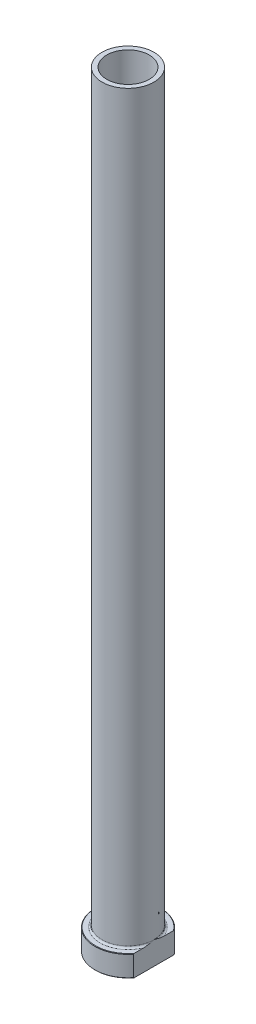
ISO-10303-21;
HEADER;
FILE_DESCRIPTION(('STEP AP214'),'2;1');
FILE_NAME('part.step','',(''),(''),'','','');
FILE_SCHEMA(('AUTOMOTIVE_DESIGN { 1 0 10303 214 1 1 1 1 }'));
ENDSEC;
DATA;
#1=APPLICATION_CONTEXT('core data for automotive mechanical design processes');
#2=APPLICATION_PROTOCOL_DEFINITION('international standard','automotive_design',2000,#1);
#3=PRODUCT_CONTEXT('',#1,'mechanical');
#4=PRODUCT('Part','Part','',(#3));
#5=PRODUCT_RELATED_PRODUCT_CATEGORY('part','',(#4));
#6=PRODUCT_DEFINITION_FORMATION('','',#4);
#7=PRODUCT_DEFINITION_CONTEXT('part definition',#1,'design');
#8=PRODUCT_DEFINITION('design','',#6,#7);
#9=PRODUCT_DEFINITION_SHAPE('','',#8);
#10=(LENGTH_UNIT() NAMED_UNIT(*) SI_UNIT(.MILLI.,.METRE.));
#11=(NAMED_UNIT(*) PLANE_ANGLE_UNIT() SI_UNIT($,.RADIAN.));
#12=(NAMED_UNIT(*) SI_UNIT($,.STERADIAN.) SOLID_ANGLE_UNIT());
#13=UNCERTAINTY_MEASURE_WITH_UNIT(LENGTH_MEASURE(1.E-05),#10,'distance_accuracy_value','');
#14=(GEOMETRIC_REPRESENTATION_CONTEXT(3) GLOBAL_UNCERTAINTY_ASSIGNED_CONTEXT((#13)) GLOBAL_UNIT_ASSIGNED_CONTEXT((#10,
#11,#12)) REPRESENTATION_CONTEXT('',''));
#15=CARTESIAN_POINT('',(0.,0.,0.));
#16=DIRECTION('',(0.,0.,1.));
#17=DIRECTION('',(1.,0.,0.));
#18=AXIS2_PLACEMENT_3D('',#15,#16,#17);
#19=CARTESIAN_POINT('',(0.,92.1876809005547,0.));
#20=DIRECTION('',(0.,1.,0.));
#21=DIRECTION('',(0.,0.,1.));
#22=AXIS2_PLACEMENT_3D('',#19,#20,#21);
#23=CYLINDRICAL_SURFACE('',#22,9.00000000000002);
#24=CARTESIAN_POINT('',(0.,325.,0.));
#25=DIRECTION('',(0.,1.,0.));
#26=DIRECTION('',(0.,0.,1.));
#27=AXIS2_PLACEMENT_3D('',#24,#25,#26);
#28=CIRCLE('',#27,9.00000000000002);
#29=CARTESIAN_POINT('',(0.,325.,9.00000000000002));
#30=VERTEX_POINT('',#29);
#31=EDGE_CURVE('E167',#30,#30,#28,.T.);
#32=ORIENTED_EDGE('',*,*,#31,.T.);
#33=EDGE_LOOP('',(#32));
#34=FACE_BOUND('',#33,.T.);
#35=CARTESIAN_POINT('',(0.,270.,0.));
#36=DIRECTION('',(0.,1.,0.));
#37=DIRECTION('',(0.,0.,1.));
#38=AXIS2_PLACEMENT_3D('',#35,#36,#37);
#39=CIRCLE('',#38,9.00000000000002);
#40=CARTESIAN_POINT('',(0.,270.,9.00000000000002));
#41=VERTEX_POINT('',#40);
#42=EDGE_CURVE('E170',#41,#41,#39,.T.);
#43=ORIENTED_EDGE('',*,*,#42,.F.);
#44=EDGE_LOOP('',(#43));
#45=FACE_BOUND('',#44,.T.);
#46=ADVANCED_FACE('F32',(#34,#45),#23,.F.);
#47=CARTESIAN_POINT('',(-9.00000000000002,325.,0.));
#48=DIRECTION('',(0.,1.,0.));
#49=DIRECTION('',(0.,0.,1.));
#50=AXIS2_PLACEMENT_3D('',#47,#48,#49);
#51=PLANE('',#50);
#52=CARTESIAN_POINT('',(0.,325.,0.));
#53=DIRECTION('',(0.,1.,0.));
#54=DIRECTION('',(0.,0.,1.));
#55=AXIS2_PLACEMENT_3D('',#52,#53,#54);
#56=CIRCLE('',#55,11.);
#57=CARTESIAN_POINT('',(0.,325.,11.));
#58=VERTEX_POINT('',#57);
#59=EDGE_CURVE('E174',#58,#58,#56,.T.);
#60=ORIENTED_EDGE('',*,*,#59,.T.);
#61=EDGE_LOOP('',(#60));
#62=FACE_BOUND('',#61,.T.);
#63=ORIENTED_EDGE('',*,*,#31,.F.);
#64=EDGE_LOOP('',(#63));
#65=FACE_BOUND('',#64,.T.);
#66=ADVANCED_FACE('F157',(#62,#65),#51,.T.);
#67=CARTESIAN_POINT('',(0.,92.1876809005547,0.));
#68=DIRECTION('',(0.,1.,0.));
#69=DIRECTION('',(0.,0.,1.));
#70=AXIS2_PLACEMENT_3D('',#67,#68,#69);
#71=CYLINDRICAL_SURFACE('',#70,11.);
#72=CARTESIAN_POINT('',(0.,9.8,0.));
#73=DIRECTION('',(0.,1.,0.));
#74=DIRECTION('',(0.,0.,1.));
#75=AXIS2_PLACEMENT_3D('',#72,#73,#74);
#76=CIRCLE('',#75,11.);
#77=CARTESIAN_POINT('',(11.,9.8,0.));
#78=VERTEX_POINT('',#77);
#79=EDGE_CURVE('E180',#78,#78,#76,.T.);
#80=ORIENTED_EDGE('',*,*,#79,.T.);
#81=EDGE_LOOP('',(#80));
#82=FACE_BOUND('',#81,.T.);
#83=ORIENTED_EDGE('',*,*,#59,.F.);
#84=EDGE_LOOP('',(#83));
#85=FACE_BOUND('',#84,.T.);
#86=ADVANCED_FACE('F162',(#82,#85),#71,.T.);
#87=CARTESIAN_POINT('',(-11.,9.,0.));
#88=DIRECTION('',(0.,1.,0.));
#89=DIRECTION('',(0.,0.,1.));
#90=AXIS2_PLACEMENT_3D('',#87,#88,#89);
#91=PLANE('',#90);
#92=DIRECTION('',(0.,0.,1.));
#93=VECTOR('',#92,1.);
#94=CARTESIAN_POINT('',(11.,9.,0.));
#95=LINE('',#94,#93);
#96=CARTESIAN_POINT('',(11.,9.,-8.33306666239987));
#97=VERTEX_POINT('',#96);
#98=CARTESIAN_POINT('',(11.,9.,-4.27083130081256));
#99=VERTEX_POINT('',#98);
#100=EDGE_CURVE('E54',#97,#99,#95,.T.);
#101=ORIENTED_EDGE('',*,*,#100,.F.);
#102=CARTESIAN_POINT('',(0.,9.,0.));
#103=DIRECTION('',(0.,1.,0.));
#104=DIRECTION('',(0.,0.,1.));
#105=AXIS2_PLACEMENT_3D('',#102,#103,#104);
#106=CIRCLE('',#105,13.8);
#107=CARTESIAN_POINT('',(11.,9.,8.33306666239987));
#108=VERTEX_POINT('',#107);
#109=EDGE_CURVE('E186',#97,#108,#106,.T.);
#110=ORIENTED_EDGE('',*,*,#109,.T.);
#111=CARTESIAN_POINT('',(11.,9.,4.27083130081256));
#112=VERTEX_POINT('',#111);
#113=EDGE_CURVE('E134',#112,#108,#95,.T.);
#114=ORIENTED_EDGE('',*,*,#113,.F.);
#115=CARTESIAN_POINT('',(0.,9.,0.));
#116=DIRECTION('',(0.,1.,0.));
#117=DIRECTION('',(0.,0.,1.));
#118=AXIS2_PLACEMENT_3D('',#115,#116,#117);
#119=CIRCLE('',#118,11.8);
#120=EDGE_CURVE('E183',#112,#99,#119,.F.);
#121=ORIENTED_EDGE('',*,*,#120,.T.);
#122=EDGE_LOOP('',(#101,#110,#114,#121));
#123=FACE_BOUND('',#122,.T.);
#124=ADVANCED_FACE('F197',(#123),#91,.T.);
#125=CARTESIAN_POINT('',(0.,92.1876809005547,0.));
#126=DIRECTION('',(0.,1.,0.));
#127=DIRECTION('',(0.,0.,1.));
#128=AXIS2_PLACEMENT_3D('',#125,#126,#127);
#129=CYLINDRICAL_SURFACE('',#128,14.);
#130=DIRECTION('',(0.,-1.,0.));
#131=VECTOR('',#130,1.);
#132=CARTESIAN_POINT('',(11.,325.,8.66025403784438));
#133=LINE('',#132,#131);
#134=CARTESIAN_POINT('',(11.,8.8,8.66025403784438));
#135=VERTEX_POINT('',#134);
#136=CARTESIAN_POINT('',(11.,0.200000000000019,8.66025403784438));
#137=VERTEX_POINT('',#136);
#138=EDGE_CURVE('E82',#135,#137,#133,.T.);
#139=ORIENTED_EDGE('',*,*,#138,.F.);
#140=CARTESIAN_POINT('',(0.,8.8,0.));
#141=DIRECTION('',(0.,1.,0.));
#142=DIRECTION('',(0.,0.,1.));
#143=AXIS2_PLACEMENT_3D('',#140,#141,#142);
#144=CIRCLE('',#143,14.);
#145=CARTESIAN_POINT('',(11.,8.8,-8.66025403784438));
#146=VERTEX_POINT('',#145);
#147=EDGE_CURVE('E95',#135,#146,#144,.F.);
#148=ORIENTED_EDGE('',*,*,#147,.T.);
#149=DIRECTION('',(0.,-1.,0.));
#150=VECTOR('',#149,1.);
#151=CARTESIAN_POINT('',(11.,325.,-8.66025403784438));
#152=LINE('',#151,#150);
#153=CARTESIAN_POINT('',(11.,0.20000000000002,-8.66025403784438));
#154=VERTEX_POINT('',#153);
#155=EDGE_CURVE('E192',#146,#154,#152,.T.);
#156=ORIENTED_EDGE('',*,*,#155,.T.);
#157=CARTESIAN_POINT('',(0.,0.20000000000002,0.));
#158=DIRECTION('',(0.,-1.,0.));
#159=DIRECTION('',(0.,0.,-1.));
#160=AXIS2_PLACEMENT_3D('',#157,#158,#159);
#161=CIRCLE('',#160,14.);
#162=EDGE_CURVE('E98',#154,#137,#161,.F.);
#163=ORIENTED_EDGE('',*,*,#162,.T.);
#164=EDGE_LOOP('',(#139,#148,#156,#163));
#165=FACE_BOUND('',#164,.T.);
#166=ADVANCED_FACE('F190',(#165),#129,.T.);
#167=CARTESIAN_POINT('',(-14.,0.,0.));
#168=DIRECTION('',(0.,-1.,0.));
#169=DIRECTION('',(0.,0.,-1.));
#170=AXIS2_PLACEMENT_3D('',#167,#168,#169);
#171=PLANE('',#170);
#172=CARTESIAN_POINT('',(0.,0.,0.));
#173=DIRECTION('',(0.,-1.,0.));
#174=DIRECTION('',(0.,0.,-1.));
#175=AXIS2_PLACEMENT_3D('',#172,#173,#174);
#176=CIRCLE('',#175,9.74999999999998);
#177=CARTESIAN_POINT('',(0.,0.,-9.74999999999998));
#178=VERTEX_POINT('',#177);
#179=EDGE_CURVE('E40',#178,#178,#176,.F.);
#180=ORIENTED_EDGE('',*,*,#179,.T.);
#181=EDGE_LOOP('',(#180));
#182=FACE_BOUND('',#181,.T.);
#183=DIRECTION('',(0.,0.,-1.));
#184=VECTOR('',#183,1.);
#185=CARTESIAN_POINT('',(11.,0.,8.66025403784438));
#186=LINE('',#185,#184);
#187=CARTESIAN_POINT('',(11.,0.,8.33306666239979));
#188=VERTEX_POINT('',#187);
#189=CARTESIAN_POINT('',(11.,0.,-8.33306666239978));
#190=VERTEX_POINT('',#189);
#191=EDGE_CURVE('E47',#188,#190,#186,.T.);
#192=ORIENTED_EDGE('',*,*,#191,.F.);
#193=CARTESIAN_POINT('',(0.,0.,0.));
#194=DIRECTION('',(0.,-1.,0.));
#195=DIRECTION('',(0.,0.,-1.));
#196=AXIS2_PLACEMENT_3D('',#193,#194,#195);
#197=CIRCLE('',#196,13.7999999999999);
#198=EDGE_CURVE('E92',#188,#190,#197,.T.);
#199=ORIENTED_EDGE('',*,*,#198,.T.);
#200=EDGE_LOOP('',(#192,#199));
#201=FACE_BOUND('',#200,.T.);
#202=ADVANCED_FACE('F91',(#182,#201),#171,.T.);
#203=CARTESIAN_POINT('',(0.,92.1876809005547,0.));
#204=DIRECTION('',(0.,1.,0.));
#205=DIRECTION('',(0.,0.,1.));
#206=AXIS2_PLACEMENT_3D('',#203,#204,#205);
#207=CYLINDRICAL_SURFACE('',#206,9.25000000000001);
#208=CARTESIAN_POINT('',(0.,0.499999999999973,0.));
#209=DIRECTION('',(0.,-1.,0.));
#210=DIRECTION('',(0.,0.,-1.));
#211=AXIS2_PLACEMENT_3D('',#208,#209,#210);
#212=CIRCLE('',#211,9.25000000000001);
#213=CARTESIAN_POINT('',(0.,0.499999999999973,-9.25000000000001));
#214=VERTEX_POINT('',#213);
#215=EDGE_CURVE('E11',#214,#214,#212,.T.);
#216=ORIENTED_EDGE('',*,*,#215,.T.);
#217=EDGE_LOOP('',(#216));
#218=FACE_BOUND('',#217,.T.);
#219=CARTESIAN_POINT('',(0.,258.,0.));
#220=DIRECTION('',(0.,1.,0.));
#221=DIRECTION('',(0.,0.,1.));
#222=AXIS2_PLACEMENT_3D('',#219,#220,#221);
#223=CIRCLE('',#222,9.25000000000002);
#224=CARTESIAN_POINT('',(0.,258.,9.25000000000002));
#225=VERTEX_POINT('',#224);
#226=EDGE_CURVE('E172',#225,#225,#223,.T.);
#227=ORIENTED_EDGE('',*,*,#226,.T.);
#228=EDGE_LOOP('',(#227));
#229=FACE_BOUND('',#228,.T.);
#230=ADVANCED_FACE('F215',(#218,#229),#207,.F.);
#231=CARTESIAN_POINT('',(0.,258.,0.));
#232=DIRECTION('',(0.,-1.,0.));
#233=DIRECTION('',(0.,0.,-1.));
#234=AXIS2_PLACEMENT_3D('',#231,#232,#233);
#235=CONICAL_SURFACE('',#234,9.25000000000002,0.0208303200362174);
#236=ORIENTED_EDGE('',*,*,#42,.T.);
#237=EDGE_LOOP('',(#236));
#238=FACE_BOUND('',#237,.T.);
#239=ORIENTED_EDGE('',*,*,#226,.F.);
#240=EDGE_LOOP('',(#239));
#241=FACE_BOUND('',#240,.T.);
#242=ADVANCED_FACE('F111',(#238,#241),#235,.F.);
#243=CARTESIAN_POINT('',(0.,9.8,0.));
#244=DIRECTION('',(0.,1.,0.));
#245=DIRECTION('',(0.,0.,1.));
#246=AXIS2_PLACEMENT_3D('',#243,#244,#245);
#247=TOROIDAL_SURFACE('',#246,11.8,0.8);
#248=ORIENTED_EDGE('',*,*,#120,.F.);
#249=CARTESIAN_POINT('',(11.,9.8,0.));
#250=CARTESIAN_POINT('',(11.,9.8000010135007,-1.1690142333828E-10));
#251=CARTESIAN_POINT('',(11.,9.80000202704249,3.62636844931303E-07));
#252=CARTESIAN_POINT('',(11.,9.80000392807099,1.38767088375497E-06));
#253=CARTESIAN_POINT('',(11.,9.80000479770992,2.07263830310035E-06));
#254=CARTESIAN_POINT('',(11.,9.80000659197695,3.71036756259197E-06));
#255=CARTESIAN_POINT('',(11.,9.80000749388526,4.6893031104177E-06));
#256=CARTESIAN_POINT('',(11.,9.8000091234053,6.73011686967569E-06));
#257=CARTESIAN_POINT('',(11.,9.80000985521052,7.78888257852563E-06));
#258=CARTESIAN_POINT('',(11.,9.8000125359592,1.18457672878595E-05));
#259=CARTESIAN_POINT('',(11.,9.80001433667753,1.49465092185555E-05));
#260=CARTESIAN_POINT('',(11.,9.8000173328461,2.112267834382E-05));
#261=CARTESIAN_POINT('',(11.,9.80001856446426,2.41813383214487E-05));
#262=CARTESIAN_POINT('',(11.,9.80002366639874,3.70013792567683E-05));
#263=CARTESIAN_POINT('',(11.,9.80002742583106,4.68141765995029E-05));
#264=CARTESIAN_POINT('',(11.,9.80003302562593,6.54425732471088E-05));
#265=CARTESIAN_POINT('',(11.,9.80003506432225,7.4198414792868E-05));
#266=CARTESIAN_POINT('',(11.,9.80004981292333,0.000138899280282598));
#267=CARTESIAN_POINT('',(11.,9.80006088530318,0.000195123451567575));
#268=CARTESIAN_POINT('',(11.,9.80010935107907,0.000417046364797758));
#269=CARTESIAN_POINT('',(11.,9.80015570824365,0.00058074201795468));
#270=CARTESIAN_POINT('',(11.,9.80033600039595,0.001228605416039));
#271=CARTESIAN_POINT('',(11.,9.80046404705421,0.00171390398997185));
#272=CARTESIAN_POINT('',(11.,9.8009765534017,0.00364143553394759));
#273=CARTESIAN_POINT('',(11.,9.80136837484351,0.0050822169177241));
#274=CARTESIAN_POINT('',(11.,9.80300002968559,0.0110983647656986));
#275=CARTESIAN_POINT('',(11.,9.80423069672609,0.0156755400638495));
#276=CARTESIAN_POINT('',(10.9999999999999,9.82474721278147,0.0919599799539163));
#277=CARTESIAN_POINT('',(11.,9.84411511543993,0.163651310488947));
#278=CARTESIAN_POINT('',(11.,9.88193435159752,0.304144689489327));
#279=CARTESIAN_POINT('',(11.,9.9003908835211,0.372945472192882));
#280=CARTESIAN_POINT('',(11.,9.93953155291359,0.519420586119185));
#281=CARTESIAN_POINT('',(11.,9.96019740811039,0.597099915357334));
#282=CARTESIAN_POINT('',(11.,10.001471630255,0.753402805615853));
#283=CARTESIAN_POINT('',(11.,10.0220767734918,0.832027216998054));
#284=CARTESIAN_POINT('',(11.,10.0569012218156,0.966276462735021));
#285=CARTESIAN_POINT('',(11.,10.0712190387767,1.02187571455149));
#286=CARTESIAN_POINT('',(11.,10.0995828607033,1.13298938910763));
#287=CARTESIAN_POINT('',(11.,10.1136294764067,1.18850365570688));
#288=CARTESIAN_POINT('',(11.,10.1546367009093,1.35225812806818));
#289=CARTESIAN_POINT('',(11.,10.1812165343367,1.46059357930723));
#290=CARTESIAN_POINT('',(11.,10.2669117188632,1.81933910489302));
#291=CARTESIAN_POINT('',(11.,10.3231642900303,2.07044657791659));
#292=CARTESIAN_POINT('',(11.,10.4250125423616,2.57779828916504));
#293=CARTESIAN_POINT('',(11.,10.4704839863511,2.8340686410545));
#294=CARTESIAN_POINT('',(11.,10.5272211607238,3.23096220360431));
#295=CARTESIAN_POINT('',(11.,10.5446090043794,3.37070252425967));
#296=CARTESIAN_POINT('',(11.,10.5730475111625,3.6508143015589));
#297=CARTESIAN_POINT('',(11.,10.5840998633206,3.79118557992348));
#298=CARTESIAN_POINT('',(11.,10.5982304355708,4.07161741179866));
#299=CARTESIAN_POINT('',(11.,10.6013499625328,4.21167576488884));
#300=CARTESIAN_POINT('',(11.,10.5975625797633,4.49161919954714));
#301=CARTESIAN_POINT('',(11.,10.5906655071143,4.63150431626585));
#302=CARTESIAN_POINT('',(11.,10.5704363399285,4.8393109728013));
#303=CARTESIAN_POINT('',(11.,10.5621463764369,4.90772588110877));
#304=CARTESIAN_POINT('',(11.,10.5417448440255,5.04405523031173));
#305=CARTESIAN_POINT('',(11.,10.5296301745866,5.11196921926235));
#306=CARTESIAN_POINT('',(11.,10.5009997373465,5.2461029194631));
#307=CARTESIAN_POINT('',(11.,10.4845340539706,5.31233305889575));
#308=CARTESIAN_POINT('',(11.,10.4461783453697,5.44314716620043));
#309=CARTESIAN_POINT('',(11.,10.424294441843,5.50773290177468));
#310=CARTESIAN_POINT('',(11.,10.3734211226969,5.63494480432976));
#311=CARTESIAN_POINT('',(11.,10.344361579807,5.69754429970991));
#312=CARTESIAN_POINT('',(11.,10.2940125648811,5.7875857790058));
#313=CARTESIAN_POINT('',(11.,10.2761248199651,5.81692841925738));
#314=CARTESIAN_POINT('',(11.,10.2377448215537,5.87384301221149));
#315=CARTESIAN_POINT('',(11.,10.2172553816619,5.90141683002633));
#316=CARTESIAN_POINT('',(11.,10.1754926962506,5.95144540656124));
#317=CARTESIAN_POINT('',(11.,10.1545053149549,5.97413611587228));
#318=CARTESIAN_POINT('',(11.,10.109817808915,6.01675330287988));
#319=CARTESIAN_POINT('',(11.,10.0861159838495,6.03667803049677));
#320=CARTESIAN_POINT('',(11.,10.0355211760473,6.07288913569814));
#321=CARTESIAN_POINT('',(11.,10.008588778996,6.08912169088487));
#322=CARTESIAN_POINT('',(11.,9.95208821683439,6.11604527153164));
#323=CARTESIAN_POINT('',(11.,9.92252876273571,6.12675386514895));
#324=CARTESIAN_POINT('',(11.,9.87044933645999,6.13915978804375));
#325=CARTESIAN_POINT('',(11.,9.84833164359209,6.14255775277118));
#326=CARTESIAN_POINT('',(11.,9.80383923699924,6.14553082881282));
#327=CARTESIAN_POINT('',(11.,9.78146463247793,6.14510750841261));
#328=CARTESIAN_POINT('',(11.,9.73715415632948,6.14047859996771));
#329=CARTESIAN_POINT('',(11.,9.71521765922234,6.13627886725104));
#330=CARTESIAN_POINT('',(11.,9.67228934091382,6.12446633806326));
#331=CARTESIAN_POINT('',(11.,9.6512982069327,6.11685110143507));
#332=CARTESIAN_POINT('',(11.,9.60293880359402,6.09531376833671));
#333=CARTESIAN_POINT('',(11.,9.57614979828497,6.08009633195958));
#334=CARTESIAN_POINT('',(11.,9.52533680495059,6.04559207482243));
#335=CARTESIAN_POINT('',(11.,9.50131971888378,6.02629542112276));
#336=CARTESIAN_POINT('',(11.,9.44252607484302,5.97248581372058));
#337=CARTESIAN_POINT('',(11.,9.40981527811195,5.93573547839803));
#338=CARTESIAN_POINT('',(11.,9.35019076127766,5.85789950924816));
#339=CARTESIAN_POINT('',(11.,9.32328591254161,5.81680738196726));
#340=CARTESIAN_POINT('',(11.,9.27531247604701,5.73382009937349));
#341=CARTESIAN_POINT('',(11.,9.25403723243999,5.69204233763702));
#342=CARTESIAN_POINT('',(11.,9.2150716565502,5.60682590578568));
#343=CARTESIAN_POINT('',(11.,9.19738479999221,5.56338567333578));
#344=CARTESIAN_POINT('',(11.,9.16492416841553,5.47505507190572));
#345=CARTESIAN_POINT('',(11.,9.15017444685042,5.43015597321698));
#346=CARTESIAN_POINT('',(11.,9.12332484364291,5.33960740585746));
#347=CARTESIAN_POINT('',(11.,9.11122363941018,5.29395832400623));
#348=CARTESIAN_POINT('',(11.,9.08512909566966,5.18461425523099));
#349=CARTESIAN_POINT('',(11.,9.07217244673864,5.12067246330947));
#350=CARTESIAN_POINT('',(11.,9.04991113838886,4.99214785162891));
#351=CARTESIAN_POINT('',(11.,9.04060805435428,4.92756476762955));
#352=CARTESIAN_POINT('',(11.,9.01731839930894,4.73294213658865));
#353=CARTESIAN_POINT('',(11.,9.00801869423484,4.60233754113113));
#354=CARTESIAN_POINT('',(11.,8.99902947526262,4.34550193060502));
#355=CARTESIAN_POINT('',(11.,8.99901276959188,4.21927902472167));
#356=CARTESIAN_POINT('',(11.,9.00595929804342,3.96771196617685));
#357=CARTESIAN_POINT('',(11.,9.01288556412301,3.84236670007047));
#358=CARTESIAN_POINT('',(11.,9.03307410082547,3.58284783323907));
#359=CARTESIAN_POINT('',(11.,9.04676832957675,3.44870920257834));
#360=CARTESIAN_POINT('',(11.,9.07939011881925,3.18114709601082));
#361=CARTESIAN_POINT('',(11.,9.09831526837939,3.04772331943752));
#362=CARTESIAN_POINT('',(11.,9.14092023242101,2.77842123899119));
#363=CARTESIAN_POINT('',(11.,9.16470161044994,2.64255921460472));
#364=CARTESIAN_POINT('',(11.,9.21593088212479,2.37116504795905));
#365=CARTESIAN_POINT('',(11.,9.24338827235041,2.23563471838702));
#366=CARTESIAN_POINT('',(11.,9.31183649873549,1.91532204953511));
#367=CARTESIAN_POINT('',(11.,9.35408384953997,1.73080986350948));
#368=CARTESIAN_POINT('',(11.,9.44184141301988,1.36477440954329));
#369=CARTESIAN_POINT('',(11.,9.48730948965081,1.18324089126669));
#370=CARTESIAN_POINT('',(11.,9.55452451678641,0.921934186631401));
#371=CARTESIAN_POINT('',(11.,9.57534575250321,0.841920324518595));
#372=CARTESIAN_POINT('',(11.,9.61742284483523,0.681633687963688));
#373=CARTESIAN_POINT('',(11.,9.63868020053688,0.601361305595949));
#374=CARTESIAN_POINT('',(11.,9.68246779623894,0.436916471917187));
#375=CARTESIAN_POINT('',(11.,9.70500908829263,0.35274702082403));
#376=CARTESIAN_POINT('',(11.,9.74991333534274,0.185809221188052));
#377=CARTESIAN_POINT('',(11.0000000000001,9.77227331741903,0.103040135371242));
#378=CARTESIAN_POINT('',(11.,9.79577053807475,0.0156708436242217));
#379=CARTESIAN_POINT('',(11.,9.79700248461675,0.0110889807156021));
#380=CARTESIAN_POINT('',(11.,9.79863444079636,0.00507176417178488));
#381=CARTESIAN_POINT('',(11.,9.79902527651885,0.00363459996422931));
#382=CARTESIAN_POINT('',(11.,9.79953658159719,0.00171158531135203));
#383=CARTESIAN_POINT('',(11.,9.7996643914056,0.00122718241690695));
#384=CARTESIAN_POINT('',(11.,9.79984439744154,0.000580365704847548));
#385=CARTESIAN_POINT('',(11.,9.79989071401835,0.000416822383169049));
#386=CARTESIAN_POINT('',(11.,9.79993914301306,0.000195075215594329));
#387=CARTESIAN_POINT('',(11.,9.79995021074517,0.000138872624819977));
#388=CARTESIAN_POINT('',(11.,9.79996494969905,7.41937272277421E-05));
#389=CARTESIAN_POINT('',(11.,9.79996698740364,6.54391041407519E-05));
#390=CARTESIAN_POINT('',(11.,9.79997258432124,4.68131883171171E-05));
#391=CARTESIAN_POINT('',(11.,9.79997634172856,3.7001588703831E-05));
#392=CARTESIAN_POINT('',(11.,9.7999814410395,2.41827838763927E-05));
#393=CARTESIAN_POINT('',(11.,9.79998267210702,2.11242150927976E-05));
#394=CARTESIAN_POINT('',(11.,9.79998566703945,1.4948136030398E-05));
#395=CARTESIAN_POINT('',(11.,9.79998746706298,1.18473819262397E-05));
#396=CARTESIAN_POINT('',(11.,9.79999014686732,7.79037294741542E-06));
#397=CARTESIAN_POINT('',(11.,9.79999087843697,6.73154510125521E-06));
#398=CARTESIAN_POINT('',(11.,9.79999250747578,4.69056454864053E-06));
#399=CARTESIAN_POINT('',(11.,9.79999340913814,3.7115229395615E-06));
#400=CARTESIAN_POINT('',(11.,9.79999520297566,2.0735436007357E-06));
#401=CARTESIAN_POINT('',(11.,9.79999607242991,1.38844123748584E-06));
#402=CARTESIAN_POINT('',(11.,9.79999797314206,3.63067802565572E-07));
#403=CARTESIAN_POINT('',(11.,9.79999898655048,1.16899927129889E-10));
#404=CARTESIAN_POINT('',(11.,9.8,0.));
#405=B_SPLINE_CURVE_WITH_KNOTS('',3,(#249,#250,#251,#252,#253,#254,#255,#256,#257,#258,#259,
#260,#261,#262,#263,#264,#265,#266,#267,#268,#269,#270,#271,#272,#273,#274,#275,#276,#277,#278,
#279,#280,#281,#282,#283,#284,#285,#286,#287,#288,#289,#290,#291,#292,#293,#294,#295,#296,#297,
#298,#299,#300,#301,#302,#303,#304,#305,#306,#307,#308,#309,#310,#311,#312,#313,#314,#315,#316,
#317,#318,#319,#320,#321,#322,#323,#324,#325,#326,#327,#328,#329,#330,#331,#332,#333,#334,#335,
#336,#337,#338,#339,#340,#341,#342,#343,#344,#345,#346,#347,#348,#349,#350,#351,#352,#353,#354,
#355,#356,#357,#358,#359,#360,#361,#362,#363,#364,#365,#366,#367,#368,#369,#370,#371,#372,#373,
#374,#375,#376,#377,#378,#379,#380,#381,#382,#383,#384,#385,#386,#387,#388,#389,#390,#391,#392,
#393,#394,#395,#396,#397,#398,#399,#400,#401,#402,#403,#404),.UNSPECIFIED.,.T.,.F.,(4,2,2,2,2,2,
2,2,2,2,2,2,2,2,2,2,2,2,2,2,2,2,2,2,2,2,2,2,2,2,2,2,2,2,2,2,2,2,2,2,2,2,2,2,2,2,2,2,2,2,2,2,2,2,
2,2,2,2,2,2,2,2,2,2,2,2,2,2,2,2,2,2,2,2,2,2,2,4),(0.,3.06075816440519E-06,6.37973016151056E-06,
1.03502600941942E-05,1.42089639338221E-05,2.49252461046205E-05,3.4808542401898E-05,
6.62739268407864E-05,9.32104281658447E-05,0.000265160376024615,0.000775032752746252,
0.00228129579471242,0.00675996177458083,0.0209798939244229,0.243756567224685,0.457458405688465,
0.698601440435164,0.94243948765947,1.11467870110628,1.28646938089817,1.62111125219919,
2.39296447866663,3.17332138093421,3.59566656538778,4.01789910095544,4.43792849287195,
4.85754566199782,5.06420795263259,5.27103820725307,5.47558418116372,5.67990009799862,
5.88629782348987,5.98928489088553,6.09216151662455,6.18469603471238,6.27728883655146,
6.37115541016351,6.46472158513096,6.53154940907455,6.59834980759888,6.66504681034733,
6.73179153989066,6.82369899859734,6.91583057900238,7.06259901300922,7.20959014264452,
7.35003074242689,7.49060673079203,7.63229046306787,7.77390328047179,7.96948934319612,
8.1651596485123,8.55744262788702,8.93589815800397,9.31234923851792,9.7167301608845,
10.1209250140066,10.5346477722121,10.9494607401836,11.5172595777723,12.0786596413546,
12.3266950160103,12.5758117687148,12.8372206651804,13.0944202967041,13.1086548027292,
13.1131222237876,13.1146257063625,13.1151351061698,13.1153069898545,13.1153339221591,
13.1153653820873,13.1153752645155,13.1153859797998,13.1153898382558,13.1153938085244,
13.1153971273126,13.1154001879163),.UNSPECIFIED.);
#406=EDGE_CURVE('E126',#112,#78,#405,.T.);
#407=ORIENTED_EDGE('',*,*,#406,.T.);
#408=ORIENTED_EDGE('',*,*,#79,.F.);
#409=CARTESIAN_POINT('',(11.,9.8,0.));
#410=CARTESIAN_POINT('',(11.,9.79999898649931,1.16906269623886E-10));
#411=CARTESIAN_POINT('',(11.,9.79999797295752,-3.62636839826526E-07));
#412=CARTESIAN_POINT('',(11.,9.79999607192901,-1.38767087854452E-06));
#413=CARTESIAN_POINT('',(11.,9.79999520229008,-2.07263829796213E-06));
#414=CARTESIAN_POINT('',(11.,9.79999340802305,-3.71036755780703E-06));
#415=CARTESIAN_POINT('',(11.,9.79999250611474,-4.68930310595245E-06));
#416=CARTESIAN_POINT('',(11.,9.79999087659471,-6.73011686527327E-06));
#417=CARTESIAN_POINT('',(11.,9.79999014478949,-7.78888257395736E-06));
#418=CARTESIAN_POINT('',(11.,9.7999874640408,-1.18457672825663E-05));
#419=CARTESIAN_POINT('',(11.,9.79998566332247,-1.49465092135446E-05));
#420=CARTESIAN_POINT('',(11.,9.7999826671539,-2.11226783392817E-05));
#421=CARTESIAN_POINT('',(11.,9.79998143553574,-2.41813383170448E-05));
#422=CARTESIAN_POINT('',(11.,9.79997633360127,-3.70013792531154E-05));
#423=CARTESIAN_POINT('',(11.,9.79997257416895,-4.6814176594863E-05));
#424=CARTESIAN_POINT('',(11.,9.79996697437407,-6.54425732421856E-05));
#425=CARTESIAN_POINT('',(11.,9.79996493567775,-7.41984147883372E-05));
#426=CARTESIAN_POINT('',(11.,9.79995018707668,-0.000138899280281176));
#427=CARTESIAN_POINT('',(11.,9.79993911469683,-0.000195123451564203));
#428=CARTESIAN_POINT('',(11.,9.79989064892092,-0.000417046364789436));
#429=CARTESIAN_POINT('',(11.,9.79984429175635,-0.000580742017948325));
#430=CARTESIAN_POINT('',(11.,9.79966399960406,-0.00122860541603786));
#431=CARTESIAN_POINT('',(11.,9.7995359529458,-0.00171390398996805));
#432=CARTESIAN_POINT('',(11.,9.79902344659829,-0.00364143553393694));
#433=CARTESIAN_POINT('',(11.,9.79863162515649,-0.00508221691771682));
#434=CARTESIAN_POINT('',(11.,9.79699997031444,-0.0110983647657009));
#435=CARTESIAN_POINT('',(11.,9.79576930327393,-0.0156755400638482));
#436=CARTESIAN_POINT('',(11.0000000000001,9.77525278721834,-0.0919599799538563));
#437=CARTESIAN_POINT('',(11.,9.75588488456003,-0.163651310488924));
#438=CARTESIAN_POINT('',(11.,9.71806564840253,-0.304144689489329));
#439=CARTESIAN_POINT('',(11.,9.69960911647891,-0.372945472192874));
#440=CARTESIAN_POINT('',(11.,9.6604684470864,-0.519420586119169));
#441=CARTESIAN_POINT('',(11.,9.63980259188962,-0.597099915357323));
#442=CARTESIAN_POINT('',(11.,9.59852836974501,-0.753402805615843));
#443=CARTESIAN_POINT('',(11.,9.5779232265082,-0.832027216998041));
#444=CARTESIAN_POINT('',(11.,9.54309877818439,-0.966276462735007));
#445=CARTESIAN_POINT('',(11.,9.52878096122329,-1.02187571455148));
#446=CARTESIAN_POINT('',(11.,9.50041713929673,-1.13298938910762));
#447=CARTESIAN_POINT('',(11.,9.48637052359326,-1.18850365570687));
#448=CARTESIAN_POINT('',(11.,9.44536329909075,-1.35225812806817));
#449=CARTESIAN_POINT('',(11.,9.41878346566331,-1.46059357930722));
#450=CARTESIAN_POINT('',(11.,9.33308828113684,-1.81933910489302));
#451=CARTESIAN_POINT('',(11.,9.27683570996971,-2.07044657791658));
#452=CARTESIAN_POINT('',(11.,9.17498745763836,-2.57779828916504));
#453=CARTESIAN_POINT('',(11.,9.12951601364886,-2.8340686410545));
#454=CARTESIAN_POINT('',(11.,9.0727788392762,-3.23096220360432));
#455=CARTESIAN_POINT('',(11.,9.05539099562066,-3.37070252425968));
#456=CARTESIAN_POINT('',(11.,9.02695248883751,-3.6508143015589));
#457=CARTESIAN_POINT('',(11.,9.01590013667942,-3.79118557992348));
#458=CARTESIAN_POINT('',(11.,9.00176956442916,-4.07161741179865));
#459=CARTESIAN_POINT('',(11.,8.99865003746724,-4.21167576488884));
#460=CARTESIAN_POINT('',(11.,9.00243742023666,-4.49161919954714));
#461=CARTESIAN_POINT('',(11.,9.00933449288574,-4.63150431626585));
#462=CARTESIAN_POINT('',(11.,9.02956366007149,-4.8393109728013));
#463=CARTESIAN_POINT('',(11.,9.03785362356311,-4.90772588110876));
#464=CARTESIAN_POINT('',(11.,9.05825515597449,-5.04405523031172));
#465=CARTESIAN_POINT('',(11.,9.07036982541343,-5.11196921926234));
#466=CARTESIAN_POINT('',(11.,9.0990002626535,-5.24610291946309));
#467=CARTESIAN_POINT('',(11.,9.11546594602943,-5.31233305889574));
#468=CARTESIAN_POINT('',(11.,9.1538216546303,-5.44314716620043));
#469=CARTESIAN_POINT('',(11.,9.17570555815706,-5.50773290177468));
#470=CARTESIAN_POINT('',(11.,9.22657887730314,-5.63494480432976));
#471=CARTESIAN_POINT('',(11.,9.25563842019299,-5.69754429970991));
#472=CARTESIAN_POINT('',(11.,9.30598743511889,-5.78758577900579));
#473=CARTESIAN_POINT('',(11.,9.32387518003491,-5.81692841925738));
#474=CARTESIAN_POINT('',(11.,9.36225517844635,-5.87384301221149));
#475=CARTESIAN_POINT('',(11.,9.38274461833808,-5.90141683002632));
#476=CARTESIAN_POINT('',(11.,9.42450730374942,-5.95144540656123));
#477=CARTESIAN_POINT('',(11.,9.44549468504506,-5.97413611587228));
#478=CARTESIAN_POINT('',(11.,9.490182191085,-6.01675330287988));
#479=CARTESIAN_POINT('',(11.,9.51388401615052,-6.03667803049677));
#480=CARTESIAN_POINT('',(11.,9.56447882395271,-6.07288913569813));
#481=CARTESIAN_POINT('',(11.,9.59141122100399,-6.08912169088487));
#482=CARTESIAN_POINT('',(11.,9.64791178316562,-6.11604527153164));
#483=CARTESIAN_POINT('',(11.,9.67747123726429,-6.12675386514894));
#484=CARTESIAN_POINT('',(11.,9.72955066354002,-6.13915978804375));
#485=CARTESIAN_POINT('',(11.,9.75166835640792,-6.14255775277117));
#486=CARTESIAN_POINT('',(11.,9.79616076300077,-6.14553082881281));
#487=CARTESIAN_POINT('',(11.,9.81853536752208,-6.14510750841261));
#488=CARTESIAN_POINT('',(11.,9.86284584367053,-6.14047859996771));
#489=CARTESIAN_POINT('',(11.,9.88478234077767,-6.13627886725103));
#490=CARTESIAN_POINT('',(11.,9.92771065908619,-6.12446633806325));
#491=CARTESIAN_POINT('',(11.,9.94870179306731,-6.11685110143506));
#492=CARTESIAN_POINT('',(11.,9.99706119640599,-6.0953137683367));
#493=CARTESIAN_POINT('',(11.,10.023850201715,-6.08009633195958));
#494=CARTESIAN_POINT('',(11.,10.0746631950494,-6.04559207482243));
#495=CARTESIAN_POINT('',(11.,10.0986802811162,-6.02629542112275));
#496=CARTESIAN_POINT('',(11.,10.157473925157,-5.97248581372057));
#497=CARTESIAN_POINT('',(11.,10.1901847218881,-5.93573547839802));
#498=CARTESIAN_POINT('',(11.,10.2498092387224,-5.85789950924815));
#499=CARTESIAN_POINT('',(11.,10.2767140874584,-5.81680738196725));
#500=CARTESIAN_POINT('',(11.,10.324687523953,-5.73382009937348));
#501=CARTESIAN_POINT('',(11.,10.34596276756,-5.692042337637));
#502=CARTESIAN_POINT('',(11.,10.3849283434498,-5.60682590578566));
#503=CARTESIAN_POINT('',(11.,10.4026152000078,-5.56338567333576));
#504=CARTESIAN_POINT('',(11.,10.4350758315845,-5.47505507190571));
#505=CARTESIAN_POINT('',(11.,10.4498255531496,-5.43015597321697));
#506=CARTESIAN_POINT('',(11.,10.4766751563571,-5.33960740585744));
#507=CARTESIAN_POINT('',(11.,10.4887763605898,-5.2939583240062));
#508=CARTESIAN_POINT('',(11.,10.5148709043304,-5.18461425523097));
#509=CARTESIAN_POINT('',(11.,10.5278275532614,-5.12067246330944));
#510=CARTESIAN_POINT('',(11.,10.5500888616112,-4.99214785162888));
#511=CARTESIAN_POINT('',(11.,10.5593919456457,-4.92756476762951));
#512=CARTESIAN_POINT('',(11.,10.5826816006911,-4.73294213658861));
#513=CARTESIAN_POINT('',(11.,10.5919813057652,-4.60233754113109));
#514=CARTESIAN_POINT('',(11.,10.6009705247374,-4.34550193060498));
#515=CARTESIAN_POINT('',(11.,10.6009872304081,-4.21927902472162));
#516=CARTESIAN_POINT('',(11.,10.5940407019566,-3.96771196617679));
#517=CARTESIAN_POINT('',(11.,10.587114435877,-3.84236670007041));
#518=CARTESIAN_POINT('',(11.,10.5669258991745,-3.58284783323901));
#519=CARTESIAN_POINT('',(11.,10.5532316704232,-3.44870920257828));
#520=CARTESIAN_POINT('',(11.,10.5206098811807,-3.18114709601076));
#521=CARTESIAN_POINT('',(11.,10.5016847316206,-3.04772331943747));
#522=CARTESIAN_POINT('',(11.,10.459079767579,-2.77842123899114));
#523=CARTESIAN_POINT('',(11.,10.4352983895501,-2.64255921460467));
#524=CARTESIAN_POINT('',(11.,10.3840691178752,-2.37116504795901));
#525=CARTESIAN_POINT('',(11.,10.3566117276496,-2.23563471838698));
#526=CARTESIAN_POINT('',(11.,10.2881635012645,-1.91532204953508));
#527=CARTESIAN_POINT('',(11.,10.24591615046,-1.73080986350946));
#528=CARTESIAN_POINT('',(11.,10.1581585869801,-1.36477440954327));
#529=CARTESIAN_POINT('',(11.,10.1126905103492,-1.18324089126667));
#530=CARTESIAN_POINT('',(11.,10.0454754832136,-0.921934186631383));
#531=CARTESIAN_POINT('',(11.,10.0246542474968,-0.841920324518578));
#532=CARTESIAN_POINT('',(11.,9.98257715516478,-0.681633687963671));
#533=CARTESIAN_POINT('',(11.,9.96131979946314,-0.60136130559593));
#534=CARTESIAN_POINT('',(11.,9.91753220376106,-0.436916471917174));
#535=CARTESIAN_POINT('',(11.,9.89499091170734,-0.352747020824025));
#536=CARTESIAN_POINT('',(11.,9.8500866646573,-0.185809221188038));
#537=CARTESIAN_POINT('',(11.,9.82772668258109,-0.103040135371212));
#538=CARTESIAN_POINT('',(11.,9.80422946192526,-0.0156708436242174));
#539=CARTESIAN_POINT('',(11.,9.80299751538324,-0.0110889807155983));
#540=CARTESIAN_POINT('',(11.,9.80136555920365,-0.00507176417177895));
#541=CARTESIAN_POINT('',(11.,9.80097472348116,-0.00363459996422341));
#542=CARTESIAN_POINT('',(11.,9.80046341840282,-0.00171158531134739));
#543=CARTESIAN_POINT('',(11.,9.8003356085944,-0.00122718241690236));
#544=CARTESIAN_POINT('',(11.,9.80015560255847,-0.000580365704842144));
#545=CARTESIAN_POINT('',(11.,9.80010928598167,-0.000416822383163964));
#546=CARTESIAN_POINT('',(11.,9.80006085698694,-0.000195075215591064));
#547=CARTESIAN_POINT('',(11.,9.80004978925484,-0.000138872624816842));
#548=CARTESIAN_POINT('',(11.,9.80003505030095,-7.41937272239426E-05));
#549=CARTESIAN_POINT('',(11.,9.80003301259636,-6.54391041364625E-05));
#550=CARTESIAN_POINT('',(11.,9.80002741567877,-4.68131883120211E-05));
#551=CARTESIAN_POINT('',(11.,9.80002365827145,-3.7001588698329E-05));
#552=CARTESIAN_POINT('',(11.,9.80001855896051,-2.41827838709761E-05));
#553=CARTESIAN_POINT('',(11.,9.80001732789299,-2.11242150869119E-05));
#554=CARTESIAN_POINT('',(11.,9.80001433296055,-1.49481360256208E-05));
#555=CARTESIAN_POINT('',(11.,9.80001253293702,-1.1847381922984E-05));
#556=CARTESIAN_POINT('',(11.,9.80000985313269,-7.79037294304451E-06));
#557=CARTESIAN_POINT('',(11.,9.80000912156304,-6.73154509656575E-06));
#558=CARTESIAN_POINT('',(11.,9.80000749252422,-4.69056454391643E-06));
#559=CARTESIAN_POINT('',(11.,9.80000659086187,-3.71152293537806E-06));
#560=CARTESIAN_POINT('',(11.,9.80000479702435,-2.07354359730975E-06));
#561=CARTESIAN_POINT('',(11.,9.80000392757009,-1.38844123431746E-06));
#562=CARTESIAN_POINT('',(11.,9.80000202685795,-3.63067798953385E-07));
#563=CARTESIAN_POINT('',(11.,9.80000101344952,-1.16895959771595E-10));
#564=CARTESIAN_POINT('',(11.,9.8,0.));
#565=B_SPLINE_CURVE_WITH_KNOTS('',3,(#409,#410,#411,#412,#413,#414,#415,#416,#417,#418,#419,
#420,#421,#422,#423,#424,#425,#426,#427,#428,#429,#430,#431,#432,#433,#434,#435,#436,#437,#438,
#439,#440,#441,#442,#443,#444,#445,#446,#447,#448,#449,#450,#451,#452,#453,#454,#455,#456,#457,
#458,#459,#460,#461,#462,#463,#464,#465,#466,#467,#468,#469,#470,#471,#472,#473,#474,#475,#476,
#477,#478,#479,#480,#481,#482,#483,#484,#485,#486,#487,#488,#489,#490,#491,#492,#493,#494,#495,
#496,#497,#498,#499,#500,#501,#502,#503,#504,#505,#506,#507,#508,#509,#510,#511,#512,#513,#514,
#515,#516,#517,#518,#519,#520,#521,#522,#523,#524,#525,#526,#527,#528,#529,#530,#531,#532,#533,
#534,#535,#536,#537,#538,#539,#540,#541,#542,#543,#544,#545,#546,#547,#548,#549,#550,#551,#552,
#553,#554,#555,#556,#557,#558,#559,#560,#561,#562,#563,#564),.UNSPECIFIED.,.T.,.F.,(4,2,2,2,2,2,
2,2,2,2,2,2,2,2,2,2,2,2,2,2,2,2,2,2,2,2,2,2,2,2,2,2,2,2,2,2,2,2,2,2,2,2,2,2,2,2,2,2,2,2,2,2,2,2,
2,2,2,2,2,2,2,2,2,2,2,2,2,2,2,2,2,2,2,2,2,2,2,4),(0.,3.06075816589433E-06,6.37973016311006E-06,
1.035026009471E-05,1.4208963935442E-05,2.49252461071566E-05,3.48085424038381E-05,
6.62739268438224E-05,9.32104281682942E-05,0.000265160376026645,0.000775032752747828,
0.00228129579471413,0.00675996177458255,0.0209798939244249,0.243756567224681,0.45745840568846,
0.69860144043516,0.942439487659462,1.11467870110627,1.28646938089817,1.62111125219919,
2.39296447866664,3.17332138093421,3.59566656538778,4.01789910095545,4.43792849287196,
4.85754566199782,5.06420795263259,5.27103820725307,5.47558418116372,5.67990009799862,
5.88629782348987,5.98928489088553,6.09216151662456,6.18469603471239,6.27728883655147,
6.37115541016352,6.46472158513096,6.53154940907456,6.59834980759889,6.66504681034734,
6.73179153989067,6.82369899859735,6.91583057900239,7.06259901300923,7.20959014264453,
7.35003074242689,7.49060673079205,7.63229046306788,7.77390328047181,7.96948934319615,
8.16515964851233,8.55744262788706,8.93589815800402,9.31234923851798,9.71673016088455,
10.1209250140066,10.5346477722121,10.9494607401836,11.5172595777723,12.0786596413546,
12.3266950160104,12.5758117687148,12.8372206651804,13.0944202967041,13.1086548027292,
13.1131222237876,13.1146257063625,13.1151351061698,13.1153069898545,13.1153339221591,
13.1153653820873,13.1153752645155,13.1153859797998,13.1153898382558,13.1153938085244,
13.1153971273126,13.1154001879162),.UNSPECIFIED.);
#566=EDGE_CURVE('E135',#78,#99,#565,.T.);
#567=ORIENTED_EDGE('',*,*,#566,.T.);
#568=EDGE_LOOP('',(#248,#407,#408,#567));
#569=FACE_BOUND('',#568,.T.);
#570=ADVANCED_FACE('F141',(#569),#247,.F.);
#571=CARTESIAN_POINT('',(0.,8.99999999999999,0.));
#572=DIRECTION('',(0.,-1.,0.));
#573=DIRECTION('',(0.,0.,-1.));
#574=AXIS2_PLACEMENT_3D('',#571,#572,#573);
#575=CONICAL_SURFACE('',#574,13.8,0.785398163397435);
#576=CARTESIAN_POINT('',(11.,0.799226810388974,-19.0534516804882));
#577=CARTESIAN_POINT('',(11.,1.0435377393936,-18.7713380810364));
#578=CARTESIAN_POINT('',(11.,1.28708512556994,-18.4885613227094));
#579=CARTESIAN_POINT('',(11.,1.77243087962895,-17.9215029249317));
#580=CARTESIAN_POINT('',(11.,2.01422921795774,-17.6372212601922));
#581=CARTESIAN_POINT('',(11.,2.49596158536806,-17.0668479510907));
#582=CARTESIAN_POINT('',(11.,2.73589466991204,-16.7807555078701));
#583=CARTESIAN_POINT('',(11.,3.21348992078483,-16.2066860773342));
#584=CARTESIAN_POINT('',(11.,3.45115209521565,-15.9187090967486));
#585=CARTESIAN_POINT('',(11.,4.17136254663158,-15.0380400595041));
#586=CARTESIAN_POINT('',(11.,4.64980550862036,-14.4419631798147));
#587=CARTESIAN_POINT('',(11.,5.35642548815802,-13.5393158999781));
#588=CARTESIAN_POINT('',(11.,5.59010018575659,-13.2370444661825));
#589=CARTESIAN_POINT('',(11.,6.05311937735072,-12.6292064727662));
#590=CARTESIAN_POINT('',(11.,6.28246396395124,-12.3236399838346));
#591=CARTESIAN_POINT('',(11.,6.73635357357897,-11.7082856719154));
#592=CARTESIAN_POINT('',(11.,6.96089131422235,-11.3984924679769));
#593=CARTESIAN_POINT('',(11.,7.40382501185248,-10.7745304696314));
#594=CARTESIAN_POINT('',(11.,7.62222089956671,-10.4603616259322));
#595=CARTESIAN_POINT('',(11.,8.05178447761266,-9.82670701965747));
#596=CARTESIAN_POINT('',(11.,8.26294571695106,-9.50721687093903));
#597=CARTESIAN_POINT('',(11.,8.67621603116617,-8.86242246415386));
#598=CARTESIAN_POINT('',(11.,8.87832530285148,-8.53711833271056));
#599=CARTESIAN_POINT('',(11.,9.26987187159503,-7.88242741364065));
#600=CARTESIAN_POINT('',(11.,9.45939671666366,-7.55309323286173));
#601=CARTESIAN_POINT('',(11.,9.8249440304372,-6.88691791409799));
#602=CARTESIAN_POINT('',(11.,10.0009648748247,-6.55007587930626));
#603=CARTESIAN_POINT('',(11.,10.3359584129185,-5.86858126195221));
#604=CARTESIAN_POINT('',(11.,10.4949563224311,-5.52394117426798));
#605=CARTESIAN_POINT('',(11.,10.7921156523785,-4.82586409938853));
#606=CARTESIAN_POINT('',(11.,10.9302852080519,-4.47243060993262));
#607=CARTESIAN_POINT('',(11.,11.1840276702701,-3.74812634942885));
#608=CARTESIAN_POINT('',(11.,11.2989969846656,-3.37704109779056));
#609=CARTESIAN_POINT('',(11.,11.4966201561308,-2.62628112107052));
#610=CARTESIAN_POINT('',(11.,11.5792791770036,-2.24660777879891));
#611=CARTESIAN_POINT('',(11.,11.706794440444,-1.48318013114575));
#612=CARTESIAN_POINT('',(11.,11.7518742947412,-1.0994639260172));
#613=CARTESIAN_POINT('',(11.,11.8017732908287,-0.329400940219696));
#614=CARTESIAN_POINT('',(11.,11.8065963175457,0.0569455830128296));
#615=CARTESIAN_POINT('',(11.,11.7755993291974,0.828327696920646));
#616=CARTESIAN_POINT('',(11.,11.7397415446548,1.21336173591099));
#617=CARTESIAN_POINT('',(11.,11.6300009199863,1.97793113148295));
#618=CARTESIAN_POINT('',(11.,11.5561107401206,2.35746541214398));
#619=CARTESIAN_POINT('',(11.,11.3744378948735,3.11099269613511));
#620=CARTESIAN_POINT('',(11.,11.2664224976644,3.48492860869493));
#621=CARTESIAN_POINT('',(11.,11.0222579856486,4.2233537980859));
#622=CARTESIAN_POINT('',(11.,10.8861087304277,4.58784302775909));
#623=CARTESIAN_POINT('',(11.,10.5561721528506,5.39220971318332));
#624=CARTESIAN_POINT('',(11.,10.3563639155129,5.82959722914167));
#625=CARTESIAN_POINT('',(11.,9.9301345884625,6.6913195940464));
#626=CARTESIAN_POINT('',(11.,9.7036980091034,7.11564666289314));
#627=CARTESIAN_POINT('',(11.,9.23013828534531,7.95366941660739));
#628=CARTESIAN_POINT('',(11.,8.98297298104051,8.36734108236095));
#629=CARTESIAN_POINT('',(11.,8.47313346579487,9.18483098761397));
#630=CARTESIAN_POINT('',(11.,8.21046237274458,9.58865118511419));
#631=CARTESIAN_POINT('',(11.,7.67160592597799,10.3902243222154));
#632=CARTESIAN_POINT('',(11.,7.39535669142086,10.7879341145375));
#633=CARTESIAN_POINT('',(11.,6.83321127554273,11.5764739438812));
#634=CARTESIAN_POINT('',(11.,6.54731471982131,11.9673037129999));
#635=CARTESIAN_POINT('',(11.,5.96814835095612,12.742746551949));
#636=CARTESIAN_POINT('',(11.,5.67488737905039,13.1273662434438));
#637=CARTESIAN_POINT('',(11.,5.08213887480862,13.891753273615));
#638=CARTESIAN_POINT('',(11.,4.78265148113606,14.2715207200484));
#639=CARTESIAN_POINT('',(11.,4.1803001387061,15.0247813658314));
#640=CARTESIAN_POINT('',(11.,3.87746557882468,15.3982981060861));
#641=CARTESIAN_POINT('',(11.,3.26753649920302,16.1419438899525));
#642=CARTESIAN_POINT('',(11.,2.96044123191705,16.5120723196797));
#643=CARTESIAN_POINT('',(11.,2.34594437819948,17.2455248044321));
#644=CARTESIAN_POINT('',(11.,2.03857939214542,17.6088795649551));
#645=CARTESIAN_POINT('',(11.,1.42096006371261,18.332995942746));
#646=CARTESIAN_POINT('',(11.,1.11070633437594,18.6937580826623));
#647=CARTESIAN_POINT('',(11.,0.799226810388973,19.0534516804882));
#648=B_SPLINE_CURVE_WITH_KNOTS('',3,(#576,#577,#578,#579,#580,#581,#582,#583,#584,#585,#586,
#587,#588,#589,#590,#591,#592,#593,#594,#595,#596,#597,#598,#599,#600,#601,#602,#603,#604,#605,
#606,#607,#608,#609,#610,#611,#612,#613,#614,#615,#616,#617,#618,#619,#620,#621,#622,#623,#624,
#625,#626,#627,#628,#629,#630,#631,#632,#633,#634,#635,#636,#637,#638,#639,#640,#641,#642,#643,
#644,#645,#646,#647),.UNSPECIFIED.,.F.,.F.,(4,2,2,2,2,2,2,2,2,2,2,2,2,2,2,2,2,2,2,2,2,2,2,2,2,2,
2,2,2,2,2,2,2,2,2,4),(0.,1.11959123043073,2.23920133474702,3.35934562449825,4.47948591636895,
6.7722963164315,7.91845486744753,9.06458887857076,10.2123513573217,11.3601267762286,
12.5089003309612,13.6576488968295,14.7973159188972,15.9371198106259,17.0752112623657,
18.2128570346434,19.3770913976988,20.5411396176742,21.6982107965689,22.8551703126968,
24.0132048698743,25.1714629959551,26.3377973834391,27.5041375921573,28.9455042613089,
30.3877135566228,31.8329307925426,33.2778584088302,34.7303948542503,36.1829877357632,
37.6339130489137,39.0848060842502,40.5273412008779,41.9701326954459,43.397876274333,
44.8253234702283),.UNSPECIFIED.);
#649=EDGE_CURVE('E133',#146,#97,#648,.T.);
#650=ORIENTED_EDGE('',*,*,#649,.F.);
#651=ORIENTED_EDGE('',*,*,#147,.F.);
#652=EDGE_CURVE('E118',#108,#135,#648,.T.);
#653=ORIENTED_EDGE('',*,*,#652,.F.);
#654=ORIENTED_EDGE('',*,*,#109,.F.);
#655=EDGE_LOOP('',(#650,#651,#653,#654));
#656=FACE_BOUND('',#655,.T.);
#657=ADVANCED_FACE('F145',(#656),#575,.T.);
#658=CARTESIAN_POINT('',(0.,0.20000000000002,0.));
#659=DIRECTION('',(0.,1.,0.));
#660=DIRECTION('',(0.,0.,1.));
#661=AXIS2_PLACEMENT_3D('',#658,#659,#660);
#662=CONICAL_SURFACE('',#661,14.,0.785398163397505);
#663=CARTESIAN_POINT('',(11.,8.20077318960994,19.0534516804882));
#664=CARTESIAN_POINT('',(11.,7.95646226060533,18.7713380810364));
#665=CARTESIAN_POINT('',(11.,7.71291487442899,18.4885613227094));
#666=CARTESIAN_POINT('',(11.,7.22756912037,17.9215029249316));
#667=CARTESIAN_POINT('',(11.,6.98577078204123,17.6372212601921));
#668=CARTESIAN_POINT('',(11.,6.50403841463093,17.0668479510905));
#669=CARTESIAN_POINT('',(11.,6.26410533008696,16.7807555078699));
#670=CARTESIAN_POINT('',(11.,5.7865100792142,16.206686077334));
#671=CARTESIAN_POINT('',(11.,5.54884790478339,15.9187090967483));
#672=CARTESIAN_POINT('',(11.,4.82863745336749,15.0380400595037));
#673=CARTESIAN_POINT('',(11.,4.35019449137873,14.4419631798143));
#674=CARTESIAN_POINT('',(11.,3.6435745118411,13.5393158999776));
#675=CARTESIAN_POINT('',(11.,3.40989981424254,13.237044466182));
#676=CARTESIAN_POINT('',(11.,2.94688062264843,12.6292064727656));
#677=CARTESIAN_POINT('',(11.,2.71753603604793,12.3236399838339));
#678=CARTESIAN_POINT('',(11.,2.26364642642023,11.7082856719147));
#679=CARTESIAN_POINT('',(11.,2.03910868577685,11.3984924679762));
#680=CARTESIAN_POINT('',(11.,1.59617498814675,10.7745304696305));
#681=CARTESIAN_POINT('',(11.,1.37777910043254,10.4603616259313));
#682=CARTESIAN_POINT('',(11.,0.948215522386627,9.82670701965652));
#683=CARTESIAN_POINT('',(11.,0.737054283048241,9.50721687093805));
#684=CARTESIAN_POINT('',(11.,0.323783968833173,8.86242246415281));
#685=CARTESIAN_POINT('',(11.,0.12167469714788,8.53711833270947));
#686=CARTESIAN_POINT('',(11.,-0.269871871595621,7.88242741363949));
#687=CARTESIAN_POINT('',(11.,-0.459396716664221,7.55309323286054));
#688=CARTESIAN_POINT('',(11.,-0.824944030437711,6.88691791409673));
#689=CARTESIAN_POINT('',(11.,-1.00096487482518,6.55007587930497));
#690=CARTESIAN_POINT('',(11.,-1.33595841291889,5.86858126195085));
#691=CARTESIAN_POINT('',(11.,-1.49495632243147,5.52394117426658));
#692=CARTESIAN_POINT('',(11.,-1.7921156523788,4.82586409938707));
#693=CARTESIAN_POINT('',(11.,-1.93028520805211,4.47243060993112));
#694=CARTESIAN_POINT('',(11.,-2.18402767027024,3.74812634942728));
#695=CARTESIAN_POINT('',(11.,-2.29899698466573,3.37704109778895));
#696=CARTESIAN_POINT('',(11.,-2.4966201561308,2.62628112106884));
#697=CARTESIAN_POINT('',(11.,-2.57927917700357,2.24660777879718));
#698=CARTESIAN_POINT('',(11.,-2.70679444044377,1.48318013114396));
#699=CARTESIAN_POINT('',(11.,-2.75187429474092,1.09946392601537));
#700=CARTESIAN_POINT('',(11.,-2.8017732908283,0.329400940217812));
#701=CARTESIAN_POINT('',(11.,-2.80659631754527,-0.0569455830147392));
#702=CARTESIAN_POINT('',(11.,-2.77559932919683,-0.828327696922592));
#703=CARTESIAN_POINT('',(11.,-2.73974154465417,-1.21336173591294));
#704=CARTESIAN_POINT('',(11.,-2.63000091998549,-1.97793113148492));
#705=CARTESIAN_POINT('',(11.,-2.55611074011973,-2.35746541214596));
#706=CARTESIAN_POINT('',(11.,-2.37443789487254,-3.11099269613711));
#707=CARTESIAN_POINT('',(11.,-2.26642249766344,-3.48492860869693));
#708=CARTESIAN_POINT('',(11.,-2.02225798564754,-4.2233537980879));
#709=CARTESIAN_POINT('',(11.,-1.88610873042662,-4.5878430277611));
#710=CARTESIAN_POINT('',(11.,-1.55617215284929,-5.39220971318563));
#711=CARTESIAN_POINT('',(11.,-1.35636391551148,-5.82959722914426));
#712=CARTESIAN_POINT('',(11.,-0.930134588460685,-6.69131959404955));
#713=CARTESIAN_POINT('',(11.,-0.703698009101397,-7.11564666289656));
#714=CARTESIAN_POINT('',(11.,-0.230138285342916,-7.95366941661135));
#715=CARTESIAN_POINT('',(11.,0.01702701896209,-8.36734108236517));
#716=CARTESIAN_POINT('',(11.,0.526866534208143,-9.18483098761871));
#717=CARTESIAN_POINT('',(11.,0.789537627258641,-9.58865118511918));
#718=CARTESIAN_POINT('',(11.,1.32839407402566,-10.3902243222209));
#719=CARTESIAN_POINT('',(11.,1.604643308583,-10.7879341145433));
#720=CARTESIAN_POINT('',(11.,2.16678872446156,-11.5764739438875));
#721=CARTESIAN_POINT('',(11.,2.45268528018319,-11.9673037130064));
#722=CARTESIAN_POINT('',(11.,3.03185164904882,-12.742746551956));
#723=CARTESIAN_POINT('',(11.,3.32511262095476,-13.1273662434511));
#724=CARTESIAN_POINT('',(11.,3.91786112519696,-13.8917532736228));
#725=CARTESIAN_POINT('',(11.,4.21734851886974,-14.2715207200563));
#726=CARTESIAN_POINT('',(11.,4.81969986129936,-15.0247813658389));
#727=CARTESIAN_POINT('',(11.,5.1225344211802,-15.3982981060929));
#728=CARTESIAN_POINT('',(11.,5.73246350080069,-16.1419438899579));
#729=CARTESIAN_POINT('',(11.,6.03955876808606,-16.5120723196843));
#730=CARTESIAN_POINT('',(11.,6.65405562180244,-17.2455248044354));
#731=CARTESIAN_POINT('',(11.,6.9614206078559,-17.6088795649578));
#732=CARTESIAN_POINT('',(11.,7.57903993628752,-18.3329959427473));
#733=CARTESIAN_POINT('',(11.,7.88929366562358,-18.6937580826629));
#734=CARTESIAN_POINT('',(11.,8.20077318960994,-19.0534516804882));
#735=B_SPLINE_CURVE_WITH_KNOTS('',3,(#663,#664,#665,#666,#667,#668,#669,#670,#671,#672,#673,
#674,#675,#676,#677,#678,#679,#680,#681,#682,#683,#684,#685,#686,#687,#688,#689,#690,#691,#692,
#693,#694,#695,#696,#697,#698,#699,#700,#701,#702,#703,#704,#705,#706,#707,#708,#709,#710,#711,
#712,#713,#714,#715,#716,#717,#718,#719,#720,#721,#722,#723,#724,#725,#726,#727,#728,#729,#730,
#731,#732,#733,#734),.UNSPECIFIED.,.F.,.F.,(4,2,2,2,2,2,2,2,2,2,2,2,2,2,2,2,2,2,2,2,2,2,2,2,2,2,
2,2,2,2,2,2,2,2,2,4),(0.,1.11959123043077,2.2392013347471,3.35934562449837,4.4794859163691,
6.77229631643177,7.91845486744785,9.06458887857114,10.2123513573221,11.3601267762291,
12.5089003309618,13.6576488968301,14.7973159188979,15.9371198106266,17.0752112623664,
18.2128570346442,19.3770913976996,20.5411396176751,21.6982107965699,22.8551703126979,
24.0132048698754,25.1714629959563,26.3377973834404,27.5041375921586,28.9455042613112,
30.387713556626,31.8329307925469,33.2778584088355,34.7303948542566,36.1829877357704,
37.6339130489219,39.0848060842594,40.5273412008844,41.9701326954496,43.397876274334,
44.8253234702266),.UNSPECIFIED.);
#736=EDGE_CURVE('E79',#137,#188,#735,.T.);
#737=ORIENTED_EDGE('',*,*,#736,.F.);
#738=ORIENTED_EDGE('',*,*,#162,.F.);
#739=EDGE_CURVE('E87',#190,#154,#735,.T.);
#740=ORIENTED_EDGE('',*,*,#739,.F.);
#741=ORIENTED_EDGE('',*,*,#198,.F.);
#742=EDGE_LOOP('',(#737,#738,#740,#741));
#743=FACE_BOUND('',#742,.T.);
#744=ADVANCED_FACE('F94',(#743),#662,.T.);
#745=CARTESIAN_POINT('',(11.,325.,8.66025403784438));
#746=DIRECTION('',(-1.,0.,0.));
#747=DIRECTION('',(0.,0.,1.));
#748=AXIS2_PLACEMENT_3D('',#745,#746,#747);
#749=PLANE('',#748);
#750=ORIENTED_EDGE('',*,*,#406,.F.);
#751=ORIENTED_EDGE('',*,*,#113,.T.);
#752=ORIENTED_EDGE('',*,*,#652,.T.);
#753=ORIENTED_EDGE('',*,*,#138,.T.);
#754=ORIENTED_EDGE('',*,*,#736,.T.);
#755=ORIENTED_EDGE('',*,*,#191,.T.);
#756=ORIENTED_EDGE('',*,*,#739,.T.);
#757=ORIENTED_EDGE('',*,*,#155,.F.);
#758=ORIENTED_EDGE('',*,*,#649,.T.);
#759=ORIENTED_EDGE('',*,*,#100,.T.);
#760=ORIENTED_EDGE('',*,*,#566,.F.);
#761=EDGE_LOOP('',(#750,#751,#752,#753,#754,#755,#756,#757,#758,#759,#760));
#762=FACE_BOUND('',#761,.T.);
#763=ADVANCED_FACE('F80',(#762),#749,.F.);
#764=CARTESIAN_POINT('',(0.,0.,0.));
#765=DIRECTION('',(0.,-1.,0.));
#766=DIRECTION('',(0.,0.,-1.));
#767=AXIS2_PLACEMENT_3D('',#764,#765,#766);
#768=CONICAL_SURFACE('',#767,9.74999999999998,0.785398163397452);
#769=ORIENTED_EDGE('',*,*,#215,.F.);
#770=EDGE_LOOP('',(#769));
#771=FACE_BOUND('',#770,.T.);
#772=ORIENTED_EDGE('',*,*,#179,.F.);
#773=EDGE_LOOP('',(#772));
#774=FACE_BOUND('',#773,.T.);
#775=ADVANCED_FACE('F34',(#771,#774),#768,.F.);
#776=CLOSED_SHELL('',(#46,#66,#86,#124,#166,#202,#230,#242,#570,#657,#744,#763,#775));
#777=MANIFOLD_SOLID_BREP('B2',#776);
#778=ADVANCED_BREP_SHAPE_REPRESENTATION('',(#18,#777),#14);
#779=SHAPE_DEFINITION_REPRESENTATION(#9,#778);
ENDSEC;
END-ISO-10303-21;
